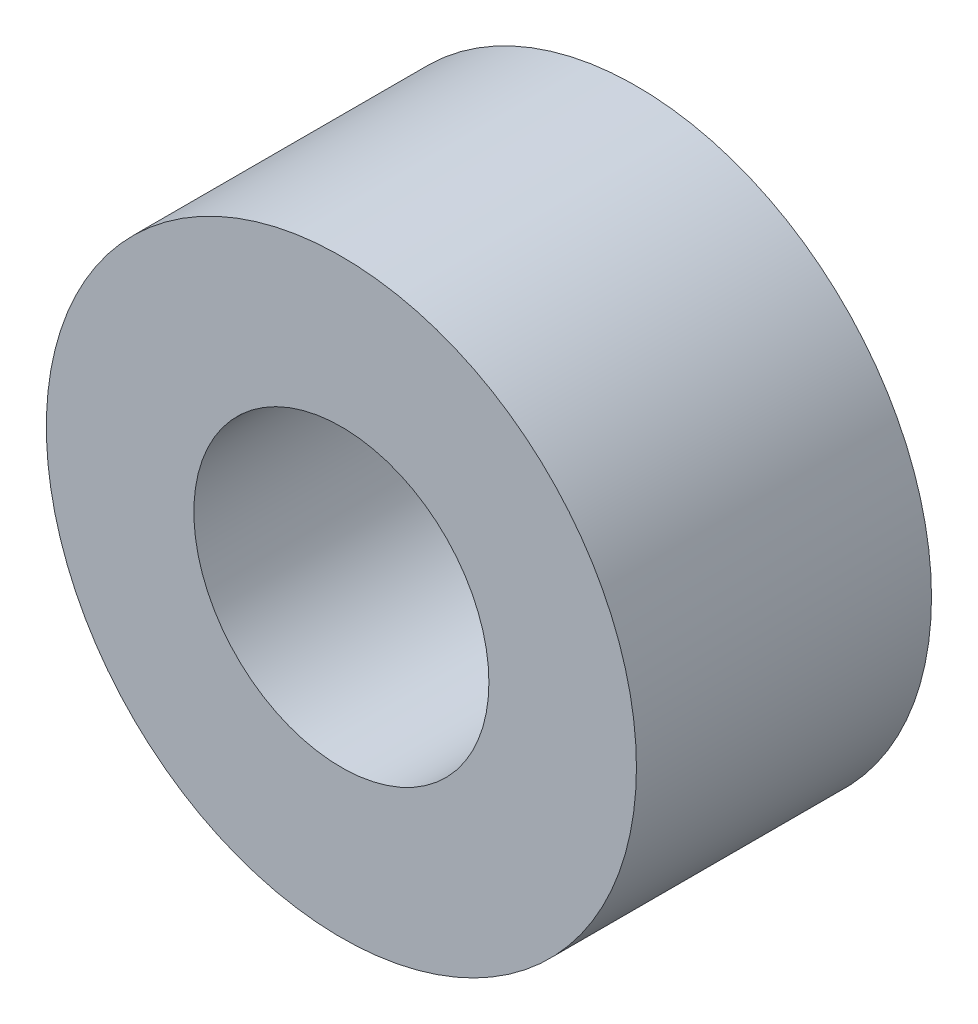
from build123d import *

# Parameters (mm, degrees)
ESQUISSE1_R        = 3
ESQUISSE1_R_2      = 1.5
BOSS_EXTRU_1_DEPTH = 3


with BuildPart() as part:
    # Esquisse1 → Boss.-Extru.1 (new body)
    with BuildSketch(Plane.XY):
        Circle(ESQUISSE1_R)
        Circle(ESQUISSE1_R_2, mode=Mode.SUBTRACT)
    extrude(amount=BOSS_EXTRU_1_DEPTH)


solid = part.part
